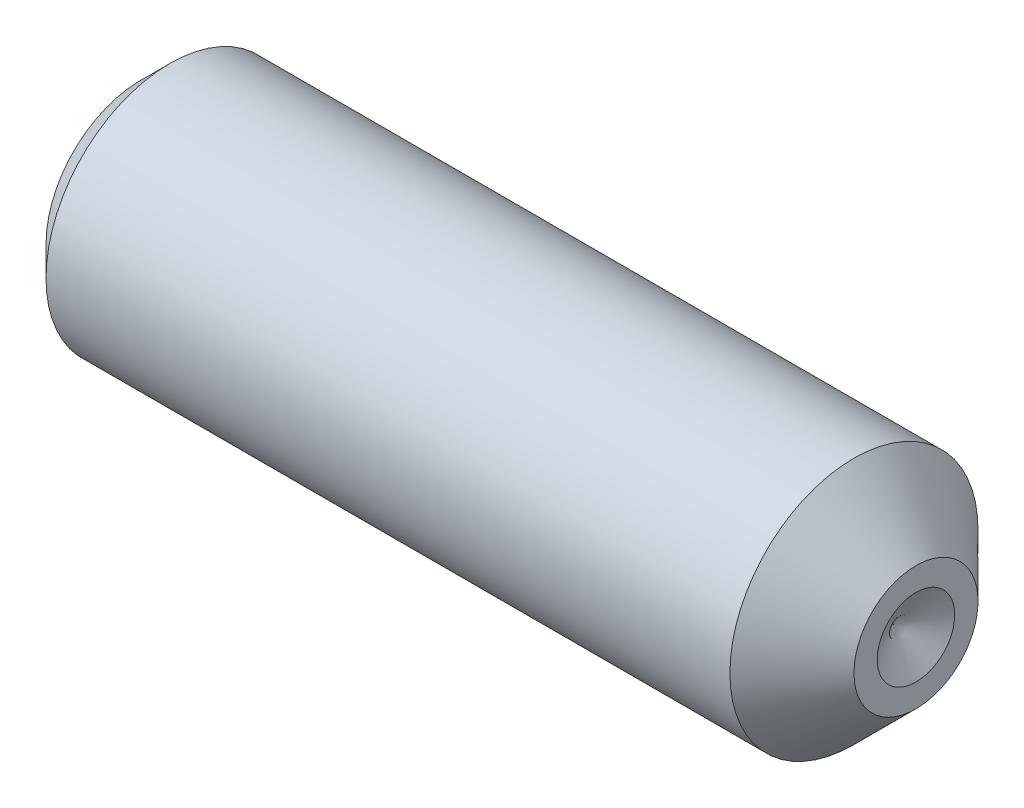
ISO-10303-21;
HEADER;
FILE_DESCRIPTION(('STEP AP214'),'2;1');
FILE_NAME('part.step','',(''),(''),'','','');
FILE_SCHEMA(('AUTOMOTIVE_DESIGN { 1 0 10303 214 1 1 1 1 }'));
ENDSEC;
DATA;
#1=APPLICATION_CONTEXT('core data for automotive mechanical design processes');
#2=APPLICATION_PROTOCOL_DEFINITION('international standard','automotive_design',2000,#1);
#3=PRODUCT_CONTEXT('',#1,'mechanical');
#4=PRODUCT('Part','Part','',(#3));
#5=PRODUCT_RELATED_PRODUCT_CATEGORY('part','',(#4));
#6=PRODUCT_DEFINITION_FORMATION('','',#4);
#7=PRODUCT_DEFINITION_CONTEXT('part definition',#1,'design');
#8=PRODUCT_DEFINITION('design','',#6,#7);
#9=PRODUCT_DEFINITION_SHAPE('','',#8);
#10=(LENGTH_UNIT() NAMED_UNIT(*) SI_UNIT(.MILLI.,.METRE.));
#11=(NAMED_UNIT(*) PLANE_ANGLE_UNIT() SI_UNIT($,.RADIAN.));
#12=(NAMED_UNIT(*) SI_UNIT($,.STERADIAN.) SOLID_ANGLE_UNIT());
#13=UNCERTAINTY_MEASURE_WITH_UNIT(LENGTH_MEASURE(1.E-05),#10,'distance_accuracy_value','');
#14=(GEOMETRIC_REPRESENTATION_CONTEXT(3) GLOBAL_UNCERTAINTY_ASSIGNED_CONTEXT((#13)) GLOBAL_UNIT_ASSIGNED_CONTEXT((#10,
#11,#12)) REPRESENTATION_CONTEXT('',''));
#15=CARTESIAN_POINT('',(0.,0.,0.));
#16=DIRECTION('',(0.,0.,1.));
#17=DIRECTION('',(1.,0.,0.));
#18=AXIS2_PLACEMENT_3D('',#15,#16,#17);
#19=CARTESIAN_POINT('',(0.700000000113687,-0.7,0.));
#20=DIRECTION('',(1.,0.,0.));
#21=DIRECTION('',(0.,0.,-1.));
#22=AXIS2_PLACEMENT_3D('',#19,#20,#21);
#23=PLANE('',#22);
#24=DIRECTION('',(0.,-0.866025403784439,-0.5));
#25=VECTOR('',#24,1.);
#26=CARTESIAN_POINT('',(0.700000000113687,0.35,-0.20207259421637));
#27=LINE('',#26,#25);
#28=CARTESIAN_POINT('',(0.700000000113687,0.35,-0.20207259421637));
#29=VERTEX_POINT('',#28);
#30=CARTESIAN_POINT('',(0.700000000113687,0.175000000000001,-0.303108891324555));
#31=VERTEX_POINT('',#30);
#32=EDGE_CURVE('E243',#29,#31,#27,.T.);
#33=ORIENTED_EDGE('',*,*,#32,.T.);
#34=CARTESIAN_POINT('',(0.700000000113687,0.,0.));
#35=DIRECTION('',(1.,0.,0.));
#36=DIRECTION('',(0.,0.,-1.));
#37=AXIS2_PLACEMENT_3D('',#34,#35,#36);
#38=CIRCLE('',#37,0.35);
#39=CARTESIAN_POINT('',(0.700000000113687,0.35,0.));
#40=VERTEX_POINT('',#39);
#41=EDGE_CURVE('E54',#31,#40,#38,.T.);
#42=ORIENTED_EDGE('',*,*,#41,.T.);
#43=DIRECTION('',(0.,0.,-1.));
#44=VECTOR('',#43,1.);
#45=CARTESIAN_POINT('',(0.700000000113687,0.35,0.202072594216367));
#46=LINE('',#45,#44);
#47=EDGE_CURVE('E239',#40,#29,#46,.T.);
#48=ORIENTED_EDGE('',*,*,#47,.T.);
#49=EDGE_LOOP('',(#33,#42,#48));
#50=FACE_BOUND('',#49,.T.);
#51=ADVANCED_FACE('F43',(#50),#23,.F.);
#52=CARTESIAN_POINT('',(0.700000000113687,0.35,0.202072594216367));
#53=VERTEX_POINT('',#52);
#54=EDGE_CURVE('E240',#53,#40,#46,.T.);
#55=ORIENTED_EDGE('',*,*,#54,.T.);
#56=CARTESIAN_POINT('',(0.700000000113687,0.175,0.303108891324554));
#57=VERTEX_POINT('',#56);
#58=EDGE_CURVE('E11',#40,#57,#38,.T.);
#59=ORIENTED_EDGE('',*,*,#58,.T.);
#60=DIRECTION('',(0.,0.866025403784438,-0.5));
#61=VECTOR('',#60,1.);
#62=CARTESIAN_POINT('',(0.700000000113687,0.,0.404145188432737));
#63=LINE('',#62,#61);
#64=EDGE_CURVE('E235',#57,#53,#63,.T.);
#65=ORIENTED_EDGE('',*,*,#64,.T.);
#66=EDGE_LOOP('',(#55,#59,#65));
#67=FACE_BOUND('',#66,.T.);
#68=ADVANCED_FACE('F133',(#67),#23,.F.);
#69=CARTESIAN_POINT('',(0.700000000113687,0.,0.404145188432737));
#70=VERTEX_POINT('',#69);
#71=EDGE_CURVE('E236',#70,#57,#63,.T.);
#72=ORIENTED_EDGE('',*,*,#71,.T.);
#73=CARTESIAN_POINT('',(0.700000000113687,-0.175,0.303108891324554));
#74=VERTEX_POINT('',#73);
#75=EDGE_CURVE('E52',#57,#74,#38,.T.);
#76=ORIENTED_EDGE('',*,*,#75,.T.);
#77=DIRECTION('',(0.,0.866025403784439,0.5));
#78=VECTOR('',#77,1.);
#79=CARTESIAN_POINT('',(0.700000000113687,-0.35,0.202072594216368));
#80=LINE('',#79,#78);
#81=EDGE_CURVE('E200',#74,#70,#80,.T.);
#82=ORIENTED_EDGE('',*,*,#81,.T.);
#83=EDGE_LOOP('',(#72,#76,#82));
#84=FACE_BOUND('',#83,.T.);
#85=ADVANCED_FACE('F139',(#84),#23,.F.);
#86=CARTESIAN_POINT('',(0.700000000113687,-0.35,0.202072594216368));
#87=VERTEX_POINT('',#86);
#88=EDGE_CURVE('E232',#87,#74,#80,.T.);
#89=ORIENTED_EDGE('',*,*,#88,.T.);
#90=CARTESIAN_POINT('',(0.700000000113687,-0.35,0.));
#91=VERTEX_POINT('',#90);
#92=EDGE_CURVE('E225',#74,#91,#38,.T.);
#93=ORIENTED_EDGE('',*,*,#92,.T.);
#94=DIRECTION('',(0.,0.,1.));
#95=VECTOR('',#94,1.);
#96=CARTESIAN_POINT('',(0.700000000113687,-0.35,-0.20207259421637));
#97=LINE('',#96,#95);
#98=EDGE_CURVE('E175',#91,#87,#97,.T.);
#99=ORIENTED_EDGE('',*,*,#98,.T.);
#100=EDGE_LOOP('',(#89,#93,#99));
#101=FACE_BOUND('',#100,.T.);
#102=ADVANCED_FACE('F154',(#101),#23,.F.);
#103=CARTESIAN_POINT('',(0.700000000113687,-0.35,-0.20207259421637));
#104=VERTEX_POINT('',#103);
#105=EDGE_CURVE('E167',#104,#91,#97,.T.);
#106=ORIENTED_EDGE('',*,*,#105,.T.);
#107=CARTESIAN_POINT('',(0.700000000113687,-0.175,-0.303108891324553));
#108=VERTEX_POINT('',#107);
#109=EDGE_CURVE('E168',#91,#108,#38,.T.);
#110=ORIENTED_EDGE('',*,*,#109,.T.);
#111=DIRECTION('',(0.,-0.866025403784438,0.5));
#112=VECTOR('',#111,1.);
#113=CARTESIAN_POINT('',(0.700000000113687,0.,-0.404145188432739));
#114=LINE('',#113,#112);
#115=EDGE_CURVE('E170',#108,#104,#114,.T.);
#116=ORIENTED_EDGE('',*,*,#115,.T.);
#117=EDGE_LOOP('',(#106,#110,#116));
#118=FACE_BOUND('',#117,.T.);
#119=ADVANCED_FACE('F145',(#118),#23,.F.);
#120=CARTESIAN_POINT('',(0.,0.6105,0.));
#121=DIRECTION('',(1.,0.,0.));
#122=DIRECTION('',(0.,0.,-1.));
#123=AXIS2_PLACEMENT_3D('',#120,#121,#122);
#124=PLANE('',#123);
#125=DIRECTION('',(0.,0.866025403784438,-0.5));
#126=VECTOR('',#125,1.);
#127=CARTESIAN_POINT('',(1.13686837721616E-10,0.,0.404145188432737));
#128=LINE('',#127,#126);
#129=CARTESIAN_POINT('',(0.,0.,0.404145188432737));
#130=VERTEX_POINT('',#129);
#131=CARTESIAN_POINT('',(1.13686837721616E-10,0.35,0.202072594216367));
#132=VERTEX_POINT('',#131);
#133=EDGE_CURVE('E184',#130,#132,#128,.T.);
#134=ORIENTED_EDGE('',*,*,#133,.F.);
#135=DIRECTION('',(0.,0.866025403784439,0.5));
#136=VECTOR('',#135,1.);
#137=CARTESIAN_POINT('',(1.13686837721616E-10,-0.35,0.202072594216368));
#138=LINE('',#137,#136);
#139=CARTESIAN_POINT('',(1.13686837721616E-10,-0.35,0.202072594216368));
#140=VERTEX_POINT('',#139);
#141=EDGE_CURVE('E68',#140,#130,#138,.T.);
#142=ORIENTED_EDGE('',*,*,#141,.F.);
#143=DIRECTION('',(0.,0.,1.));
#144=VECTOR('',#143,1.);
#145=CARTESIAN_POINT('',(1.13686837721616E-10,-0.35,-0.20207259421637));
#146=LINE('',#145,#144);
#147=CARTESIAN_POINT('',(1.13686837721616E-10,-0.35,-0.20207259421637));
#148=VERTEX_POINT('',#147);
#149=EDGE_CURVE('E197',#148,#140,#146,.T.);
#150=ORIENTED_EDGE('',*,*,#149,.F.);
#151=DIRECTION('',(0.,-0.866025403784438,0.5));
#152=VECTOR('',#151,1.);
#153=CARTESIAN_POINT('',(1.13686837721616E-10,0.,-0.404145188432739));
#154=LINE('',#153,#152);
#155=CARTESIAN_POINT('',(1.13686837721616E-10,0.,-0.404145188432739));
#156=VERTEX_POINT('',#155);
#157=EDGE_CURVE('E194',#156,#148,#154,.T.);
#158=ORIENTED_EDGE('',*,*,#157,.F.);
#159=DIRECTION('',(0.,-0.866025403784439,-0.5));
#160=VECTOR('',#159,1.);
#161=CARTESIAN_POINT('',(1.13686837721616E-10,0.35,-0.20207259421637));
#162=LINE('',#161,#160);
#163=CARTESIAN_POINT('',(1.13686837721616E-10,0.35,-0.20207259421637));
#164=VERTEX_POINT('',#163);
#165=EDGE_CURVE('E191',#164,#156,#162,.T.);
#166=ORIENTED_EDGE('',*,*,#165,.F.);
#167=DIRECTION('',(0.,0.,-1.));
#168=VECTOR('',#167,1.);
#169=CARTESIAN_POINT('',(1.13686837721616E-10,0.35,0.202072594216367));
#170=LINE('',#169,#168);
#171=EDGE_CURVE('E188',#132,#164,#170,.T.);
#172=ORIENTED_EDGE('',*,*,#171,.F.);
#173=EDGE_LOOP('',(#134,#142,#150,#158,#166,#172));
#174=FACE_BOUND('',#173,.T.);
#175=CARTESIAN_POINT('',(0.,0.,0.));
#176=DIRECTION('',(-1.,0.,0.));
#177=DIRECTION('',(0.,0.,1.));
#178=AXIS2_PLACEMENT_3D('',#175,#176,#177);
#179=CIRCLE('',#178,0.6105);
#180=CARTESIAN_POINT('',(0.,0.,0.6105));
#181=VERTEX_POINT('',#180);
#182=EDGE_CURVE('E203',#181,#181,#179,.T.);
#183=ORIENTED_EDGE('',*,*,#182,.T.);
#184=EDGE_LOOP('',(#183));
#185=FACE_BOUND('',#184,.T.);
#186=ADVANCED_FACE('F45',(#174,#185),#124,.F.);
#187=CARTESIAN_POINT('',(5.,0.,0.));
#188=DIRECTION('',(-1.,0.,0.));
#189=DIRECTION('',(0.,0.,1.));
#190=AXIS2_PLACEMENT_3D('',#187,#188,#189);
#191=PLANE('',#190);
#192=CARTESIAN_POINT('',(4.99999999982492,0.,0.));
#193=DIRECTION('',(1.,0.,0.));
#194=DIRECTION('',(0.,0.,-1.));
#195=AXIS2_PLACEMENT_3D('',#192,#193,#194);
#196=CIRCLE('',#195,0.25);
#197=CARTESIAN_POINT('',(4.99999999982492,0.,-0.25));
#198=VERTEX_POINT('',#197);
#199=EDGE_CURVE('E185',#198,#198,#196,.T.);
#200=ORIENTED_EDGE('',*,*,#199,.F.);
#201=EDGE_LOOP('',(#200));
#202=FACE_BOUND('',#201,.T.);
#203=CARTESIAN_POINT('',(5.,0.,0.));
#204=DIRECTION('',(-1.,0.,0.));
#205=DIRECTION('',(0.,0.,1.));
#206=AXIS2_PLACEMENT_3D('',#203,#204,#205);
#207=CIRCLE('',#206,0.4);
#208=CARTESIAN_POINT('',(5.,0.,0.4));
#209=VERTEX_POINT('',#208);
#210=EDGE_CURVE('E47',#209,#209,#207,.T.);
#211=ORIENTED_EDGE('',*,*,#210,.F.);
#212=EDGE_LOOP('',(#211));
#213=FACE_BOUND('',#212,.T.);
#214=ADVANCED_FACE('F161',(#202,#213),#191,.F.);
#215=CARTESIAN_POINT('',(5.,0.,0.));
#216=DIRECTION('',(-1.,0.,0.));
#217=DIRECTION('',(0.,0.,1.));
#218=AXIS2_PLACEMENT_3D('',#215,#216,#217);
#219=CONICAL_SURFACE('',#218,0.4,0.785398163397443);
#220=CARTESIAN_POINT('',(4.59999999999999,0.,0.));
#221=DIRECTION('',(-1.,0.,0.));
#222=DIRECTION('',(0.,0.,1.));
#223=AXIS2_PLACEMENT_3D('',#220,#221,#222);
#224=CIRCLE('',#223,0.8);
#225=CARTESIAN_POINT('',(4.59999999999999,0.,0.8));
#226=VERTEX_POINT('',#225);
#227=EDGE_CURVE('E216',#226,#226,#224,.T.);
#228=ORIENTED_EDGE('',*,*,#227,.F.);
#229=EDGE_LOOP('',(#228));
#230=FACE_BOUND('',#229,.T.);
#231=ORIENTED_EDGE('',*,*,#210,.T.);
#232=EDGE_LOOP('',(#231));
#233=FACE_BOUND('',#232,.T.);
#234=ADVANCED_FACE('F287',(#230,#233),#219,.T.);
#235=CARTESIAN_POINT('',(-10.7450145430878,0.,0.));
#236=DIRECTION('',(-1.,0.,0.));
#237=DIRECTION('',(0.,0.,1.));
#238=AXIS2_PLACEMENT_3D('',#235,#236,#237);
#239=CYLINDRICAL_SURFACE('',#238,0.8);
#240=CARTESIAN_POINT('',(0.189500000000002,0.,0.));
#241=DIRECTION('',(-1.,0.,0.));
#242=DIRECTION('',(0.,0.,1.));
#243=AXIS2_PLACEMENT_3D('',#240,#241,#242);
#244=CIRCLE('',#243,0.799999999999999);
#245=CARTESIAN_POINT('',(0.189500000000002,0.,0.799999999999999));
#246=VERTEX_POINT('',#245);
#247=EDGE_CURVE('E214',#246,#246,#244,.T.);
#248=ORIENTED_EDGE('',*,*,#247,.F.);
#249=EDGE_LOOP('',(#248));
#250=FACE_BOUND('',#249,.T.);
#251=ORIENTED_EDGE('',*,*,#227,.T.);
#252=EDGE_LOOP('',(#251));
#253=FACE_BOUND('',#252,.T.);
#254=ADVANCED_FACE('F283',(#250,#253),#239,.T.);
#255=CARTESIAN_POINT('',(0.189500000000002,0.,0.));
#256=DIRECTION('',(1.,0.,0.));
#257=DIRECTION('',(0.,0.,-1.));
#258=AXIS2_PLACEMENT_3D('',#255,#256,#257);
#259=CONICAL_SURFACE('',#258,0.799999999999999,0.785398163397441);
#260=ORIENTED_EDGE('',*,*,#182,.F.);
#261=EDGE_LOOP('',(#260));
#262=FACE_BOUND('',#261,.T.);
#263=ORIENTED_EDGE('',*,*,#247,.T.);
#264=EDGE_LOOP('',(#263));
#265=FACE_BOUND('',#264,.T.);
#266=ADVANCED_FACE('F280',(#262,#265),#259,.T.);
#267=CARTESIAN_POINT('',(0.700000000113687,-0.35,0.202072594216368));
#268=DIRECTION('',(0.,-0.5,0.866025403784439));
#269=DIRECTION('',(0.,-0.866025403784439,-0.5));
#270=AXIS2_PLACEMENT_3D('',#267,#268,#269);
#271=PLANE('',#270);
#272=ORIENTED_EDGE('',*,*,#141,.T.);
#273=DIRECTION('',(-1.,0.,0.));
#274=VECTOR('',#273,1.);
#275=CARTESIAN_POINT('',(0.700000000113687,0.,0.404145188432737));
#276=LINE('',#275,#274);
#277=EDGE_CURVE('E174',#70,#130,#276,.T.);
#278=ORIENTED_EDGE('',*,*,#277,.F.);
#279=ORIENTED_EDGE('',*,*,#81,.F.);
#280=ORIENTED_EDGE('',*,*,#88,.F.);
#281=DIRECTION('',(-1.,0.,0.));
#282=VECTOR('',#281,1.);
#283=CARTESIAN_POINT('',(0.700000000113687,-0.35,0.202072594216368));
#284=LINE('',#283,#282);
#285=EDGE_CURVE('E201',#87,#140,#284,.T.);
#286=ORIENTED_EDGE('',*,*,#285,.T.);
#287=EDGE_LOOP('',(#272,#278,#279,#280,#286));
#288=FACE_BOUND('',#287,.T.);
#289=ADVANCED_FACE('F265',(#288),#271,.F.);
#290=CARTESIAN_POINT('',(0.700000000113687,-0.35,-0.20207259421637));
#291=DIRECTION('',(0.,-1.,0.));
#292=DIRECTION('',(0.,0.,-1.));
#293=AXIS2_PLACEMENT_3D('',#290,#291,#292);
#294=PLANE('',#293);
#295=ORIENTED_EDGE('',*,*,#149,.T.);
#296=ORIENTED_EDGE('',*,*,#285,.F.);
#297=ORIENTED_EDGE('',*,*,#98,.F.);
#298=ORIENTED_EDGE('',*,*,#105,.F.);
#299=DIRECTION('',(-1.,0.,0.));
#300=VECTOR('',#299,1.);
#301=CARTESIAN_POINT('',(0.700000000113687,-0.35,-0.20207259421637));
#302=LINE('',#301,#300);
#303=EDGE_CURVE('E204',#104,#148,#302,.T.);
#304=ORIENTED_EDGE('',*,*,#303,.T.);
#305=EDGE_LOOP('',(#295,#296,#297,#298,#304));
#306=FACE_BOUND('',#305,.T.);
#307=ADVANCED_FACE('F254',(#306),#294,.F.);
#308=CARTESIAN_POINT('',(0.700000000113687,0.,-0.404145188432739));
#309=DIRECTION('',(0.,-0.5,-0.866025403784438));
#310=DIRECTION('',(0.,0.866025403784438,-0.5));
#311=AXIS2_PLACEMENT_3D('',#308,#309,#310);
#312=PLANE('',#311);
#313=ORIENTED_EDGE('',*,*,#157,.T.);
#314=ORIENTED_EDGE('',*,*,#303,.F.);
#315=ORIENTED_EDGE('',*,*,#115,.F.);
#316=CARTESIAN_POINT('',(0.700000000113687,0.,-0.404145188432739));
#317=VERTEX_POINT('',#316);
#318=EDGE_CURVE('E179',#317,#108,#114,.T.);
#319=ORIENTED_EDGE('',*,*,#318,.F.);
#320=DIRECTION('',(-1.,0.,0.));
#321=VECTOR('',#320,1.);
#322=CARTESIAN_POINT('',(0.700000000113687,0.,-0.404145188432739));
#323=LINE('',#322,#321);
#324=EDGE_CURVE('E206',#317,#156,#323,.T.);
#325=ORIENTED_EDGE('',*,*,#324,.T.);
#326=EDGE_LOOP('',(#313,#314,#315,#319,#325));
#327=FACE_BOUND('',#326,.T.);
#328=ADVANCED_FACE('F252',(#327),#312,.F.);
#329=CARTESIAN_POINT('',(0.700000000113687,0.35,-0.20207259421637));
#330=DIRECTION('',(0.,0.5,-0.866025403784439));
#331=DIRECTION('',(0.,0.866025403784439,0.5));
#332=AXIS2_PLACEMENT_3D('',#329,#330,#331);
#333=PLANE('',#332);
#334=ORIENTED_EDGE('',*,*,#165,.T.);
#335=ORIENTED_EDGE('',*,*,#324,.F.);
#336=EDGE_CURVE('E242',#31,#317,#27,.T.);
#337=ORIENTED_EDGE('',*,*,#336,.F.);
#338=ORIENTED_EDGE('',*,*,#32,.F.);
#339=DIRECTION('',(-1.,0.,0.));
#340=VECTOR('',#339,1.);
#341=CARTESIAN_POINT('',(0.700000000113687,0.35,-0.20207259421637));
#342=LINE('',#341,#340);
#343=EDGE_CURVE('E208',#29,#164,#342,.T.);
#344=ORIENTED_EDGE('',*,*,#343,.T.);
#345=EDGE_LOOP('',(#334,#335,#337,#338,#344));
#346=FACE_BOUND('',#345,.T.);
#347=ADVANCED_FACE('F248',(#346),#333,.F.);
#348=CARTESIAN_POINT('',(0.700000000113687,0.35,0.202072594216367));
#349=DIRECTION('',(0.,1.,0.));
#350=DIRECTION('',(0.,0.,1.));
#351=AXIS2_PLACEMENT_3D('',#348,#349,#350);
#352=PLANE('',#351);
#353=ORIENTED_EDGE('',*,*,#171,.T.);
#354=ORIENTED_EDGE('',*,*,#343,.F.);
#355=ORIENTED_EDGE('',*,*,#47,.F.);
#356=ORIENTED_EDGE('',*,*,#54,.F.);
#357=DIRECTION('',(-1.,0.,0.));
#358=VECTOR('',#357,1.);
#359=CARTESIAN_POINT('',(0.700000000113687,0.35,0.202072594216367));
#360=LINE('',#359,#358);
#361=EDGE_CURVE('E177',#53,#132,#360,.T.);
#362=ORIENTED_EDGE('',*,*,#361,.T.);
#363=EDGE_LOOP('',(#353,#354,#355,#356,#362));
#364=FACE_BOUND('',#363,.T.);
#365=ADVANCED_FACE('F149',(#364),#352,.F.);
#366=CARTESIAN_POINT('',(0.700000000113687,0.,0.404145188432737));
#367=DIRECTION('',(0.,0.5,0.866025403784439));
#368=DIRECTION('',(0.,-0.866025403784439,0.5));
#369=AXIS2_PLACEMENT_3D('',#366,#367,#368);
#370=PLANE('',#369);
#371=ORIENTED_EDGE('',*,*,#133,.T.);
#372=ORIENTED_EDGE('',*,*,#361,.F.);
#373=ORIENTED_EDGE('',*,*,#64,.F.);
#374=ORIENTED_EDGE('',*,*,#71,.F.);
#375=ORIENTED_EDGE('',*,*,#277,.T.);
#376=EDGE_LOOP('',(#371,#372,#373,#374,#375));
#377=FACE_BOUND('',#376,.T.);
#378=ADVANCED_FACE('F143',(#377),#370,.F.);
#379=ORIENTED_EDGE('',*,*,#318,.T.);
#380=EDGE_CURVE('E221',#108,#31,#38,.T.);
#381=ORIENTED_EDGE('',*,*,#380,.T.);
#382=ORIENTED_EDGE('',*,*,#336,.T.);
#383=EDGE_LOOP('',(#379,#381,#382));
#384=FACE_BOUND('',#383,.T.);
#385=ADVANCED_FACE('F129',(#384),#23,.F.);
#386=CARTESIAN_POINT('',(4.99999999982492,0.,0.));
#387=DIRECTION('',(1.,0.,0.));
#388=DIRECTION('',(0.,0.,-1.));
#389=AXIS2_PLACEMENT_3D('',#386,#387,#388);
#390=CONICAL_SURFACE('',#389,0.25,1.0471975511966);
#391=CARTESIAN_POINT('',(4.85566243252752,0.,0.));
#392=VERTEX_POINT('',#391);
#393=VERTEX_LOOP('',#392);
#394=FACE_BOUND('',#393,.T.);
#395=ORIENTED_EDGE('',*,*,#199,.T.);
#396=EDGE_LOOP('',(#395));
#397=FACE_BOUND('',#396,.T.);
#398=ADVANCED_FACE('F123',(#394,#397),#390,.F.);
#399=CARTESIAN_POINT('',(0.902072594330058,0.,0.));
#400=DIRECTION('',(-1.,0.,0.));
#401=DIRECTION('',(0.,0.,1.));
#402=AXIS2_PLACEMENT_3D('',#399,#400,#401);
#403=CONICAL_SURFACE('',#402,0.,1.04719755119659);
#404=ORIENTED_EDGE('',*,*,#41,.F.);
#405=ORIENTED_EDGE('',*,*,#380,.F.);
#406=ORIENTED_EDGE('',*,*,#109,.F.);
#407=ORIENTED_EDGE('',*,*,#92,.F.);
#408=ORIENTED_EDGE('',*,*,#75,.F.);
#409=ORIENTED_EDGE('',*,*,#58,.F.);
#410=EDGE_LOOP('',(#404,#405,#406,#407,#408,#409));
#411=FACE_BOUND('',#410,.T.);
#412=CARTESIAN_POINT('',(0.902072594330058,0.,0.));
#413=VERTEX_POINT('',#412);
#414=VERTEX_LOOP('',#413);
#415=FACE_BOUND('',#414,.T.);
#416=ADVANCED_FACE('F121',(#411,#415),#403,.F.);
#417=CLOSED_SHELL('',(#51,#68,#85,#102,#119,#186,#214,#234,#254,#266,#289,#307,#328,#347,#365,
#378,#385,#398,#416));
#418=MANIFOLD_SOLID_BREP('B2',#417);
#419=ADVANCED_BREP_SHAPE_REPRESENTATION('',(#18,#418),#14);
#420=SHAPE_DEFINITION_REPRESENTATION(#9,#419);
ENDSEC;
END-ISO-10303-21;
